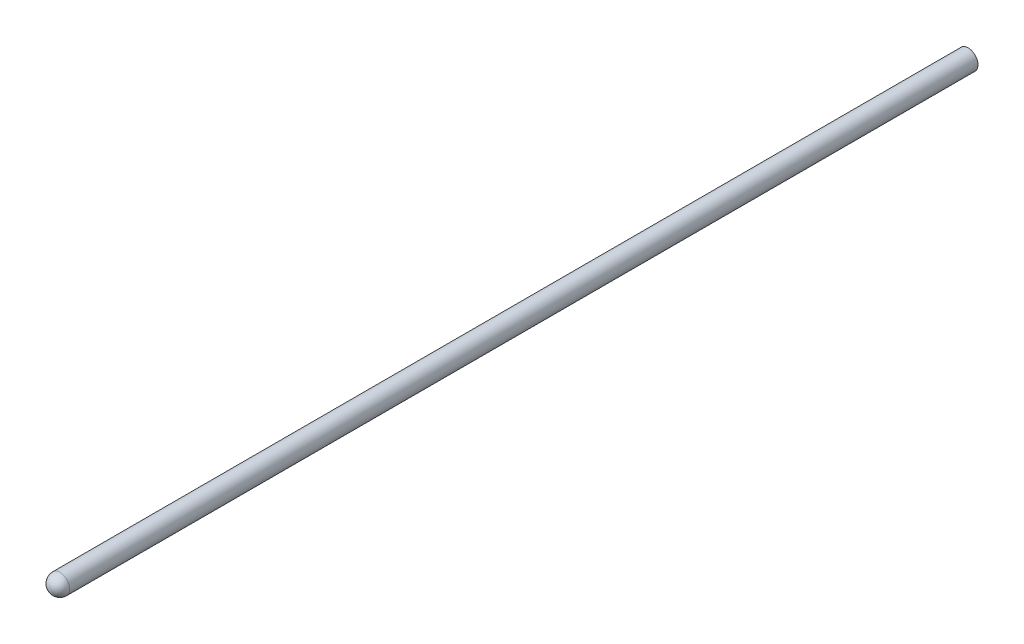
from build123d import *

# Parameters (mm, degrees)
GK_W = 140
GK_H = 1.5


with BuildPart() as part:
    # GK → Rotation_GK (revolve)
    with BuildSketch(Plane(origin=(0, 0, 0), x_dir=(0, 0, -1), z_dir=(1, 0, 0))):
        with Locations((-70, 0.75)):
            Rectangle(GK_W, GK_H)
    revolve(axis=Axis((0, 0, 0), (0, 0, 1)))

    # Ende vo → Schnitt-Rota_Ende vo (revolve, cut)
    with BuildSketch(Plane(origin=(0, 0, 0), x_dir=(0, 0, -1), z_dir=(1, 0, 0))):
        with BuildLine():
            Line((-141, 0), (-141, 1.5))
            Line((-141, 1.5), (-138.5, 1.5))
            ThreePointArc((-138.5, 1.5), (-139.560660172, 1.060660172), (-140, 0))
            Line((-140, 0), (-141, 0))
        make_face()
    revolve(axis=Axis((0, 0, 141), (0, 0, -1)), mode=Mode.SUBTRACT)


solid = part.part
